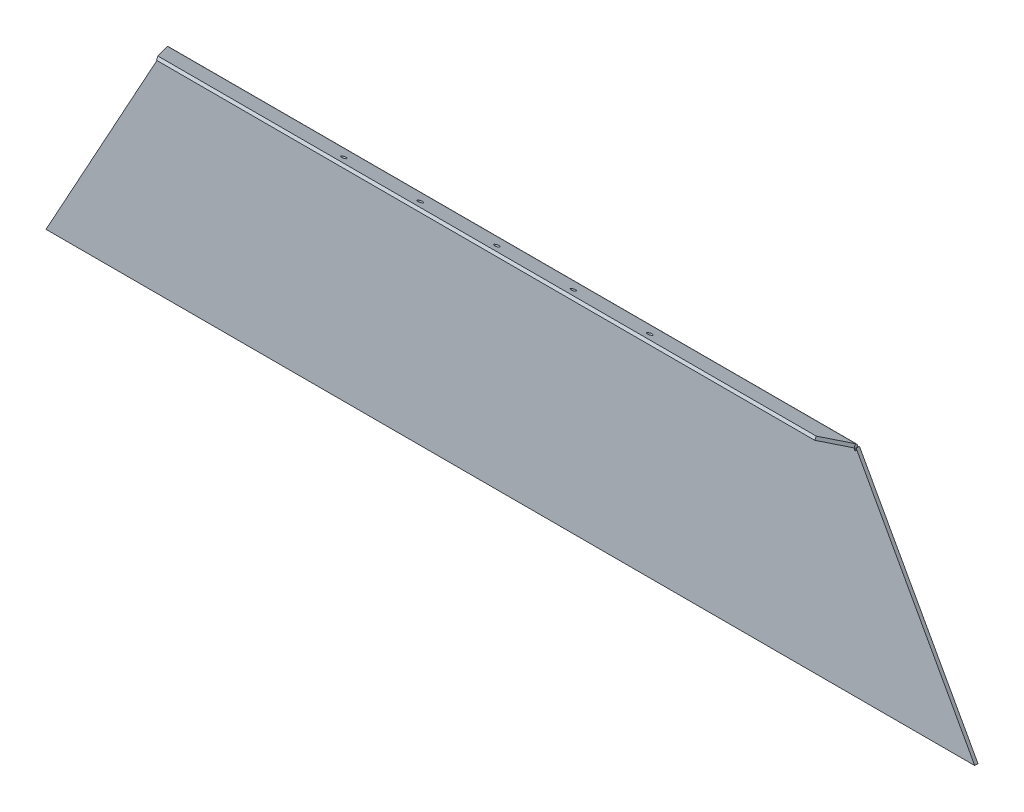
ISO-10303-21;
HEADER;
FILE_DESCRIPTION(('STEP AP214'),'2;1');
FILE_NAME('part.step','',(''),(''),'','','');
FILE_SCHEMA(('AUTOMOTIVE_DESIGN { 1 0 10303 214 1 1 1 1 }'));
ENDSEC;
DATA;
#1=APPLICATION_CONTEXT('core data for automotive mechanical design processes');
#2=APPLICATION_PROTOCOL_DEFINITION('international standard','automotive_design',2000,#1);
#3=PRODUCT_CONTEXT('',#1,'mechanical');
#4=PRODUCT('Part','Part','',(#3));
#5=PRODUCT_RELATED_PRODUCT_CATEGORY('part','',(#4));
#6=PRODUCT_DEFINITION_FORMATION('','',#4);
#7=PRODUCT_DEFINITION_CONTEXT('part definition',#1,'design');
#8=PRODUCT_DEFINITION('design','',#6,#7);
#9=PRODUCT_DEFINITION_SHAPE('','',#8);
#10=(LENGTH_UNIT() NAMED_UNIT(*) SI_UNIT(.MILLI.,.METRE.));
#11=(NAMED_UNIT(*) PLANE_ANGLE_UNIT() SI_UNIT($,.RADIAN.));
#12=(NAMED_UNIT(*) SI_UNIT($,.STERADIAN.) SOLID_ANGLE_UNIT());
#13=UNCERTAINTY_MEASURE_WITH_UNIT(LENGTH_MEASURE(1.E-05),#10,'distance_accuracy_value','');
#14=(GEOMETRIC_REPRESENTATION_CONTEXT(3) GLOBAL_UNCERTAINTY_ASSIGNED_CONTEXT((#13)) GLOBAL_UNIT_ASSIGNED_CONTEXT((#10,
#11,#12)) REPRESENTATION_CONTEXT('',''));
#15=CARTESIAN_POINT('',(0.,0.,0.));
#16=DIRECTION('',(0.,0.,1.));
#17=DIRECTION('',(1.,0.,0.));
#18=AXIS2_PLACEMENT_3D('',#15,#16,#17);
#19=CARTESIAN_POINT('',(-633.,-5.45454545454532,5.99999999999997));
#20=DIRECTION('',(1.,0.,0.));
#21=DIRECTION('',(0.,0.,-1.));
#22=AXIS2_PLACEMENT_3D('',#19,#20,#21);
#23=PLANE('',#22);
#24=DIRECTION('',(0.,-1.,0.));
#25=VECTOR('',#24,1.);
#26=CARTESIAN_POINT('',(-633.,0.,0.));
#27=LINE('',#26,#25);
#28=CARTESIAN_POINT('',(-633.,-5.45454545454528,0.));
#29=VERTEX_POINT('',#28);
#30=CARTESIAN_POINT('',(-633.,-10.0895334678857,0.));
#31=VERTEX_POINT('',#30);
#32=EDGE_CURVE('E13',#29,#31,#27,.T.);
#33=ORIENTED_EDGE('',*,*,#32,.F.);
#34=DIRECTION('',(0.,0.,-1.));
#35=VECTOR('',#34,1.);
#36=CARTESIAN_POINT('',(-633.,-5.45454545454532,5.99999999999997));
#37=LINE('',#36,#35);
#38=CARTESIAN_POINT('',(-633.,-5.45454545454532,5.99999999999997));
#39=VERTEX_POINT('',#38);
#40=EDGE_CURVE('E346',#39,#29,#37,.T.);
#41=ORIENTED_EDGE('',*,*,#40,.F.);
#42=DIRECTION('',(0.,-1.,0.));
#43=VECTOR('',#42,1.);
#44=CARTESIAN_POINT('',(-633.,-5.45454545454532,5.99999999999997));
#45=LINE('',#44,#43);
#46=CARTESIAN_POINT('',(-633.,-10.0895334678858,5.99999999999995));
#47=VERTEX_POINT('',#46);
#48=EDGE_CURVE('E247',#39,#47,#45,.T.);
#49=ORIENTED_EDGE('',*,*,#48,.T.);
#50=DIRECTION('',(0.,0.,-1.));
#51=VECTOR('',#50,1.);
#52=CARTESIAN_POINT('',(-633.,-10.0895334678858,5.99999999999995));
#53=LINE('',#52,#51);
#54=EDGE_CURVE('E337',#47,#31,#53,.T.);
#55=ORIENTED_EDGE('',*,*,#54,.T.);
#56=EDGE_LOOP('',(#33,#41,#49,#55));
#57=FACE_BOUND('',#56,.T.);
#58=ADVANCED_FACE('F51',(#57),#23,.T.);
#59=CARTESIAN_POINT('',(-633.,-10.0895334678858,5.99999999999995));
#60=DIRECTION('',(0.,1.,0.));
#61=DIRECTION('',(0.,0.,1.));
#62=AXIS2_PLACEMENT_3D('',#59,#60,#61);
#63=PLANE('',#62);
#64=DIRECTION('',(1.,0.,0.));
#65=VECTOR('',#64,1.);
#66=CARTESIAN_POINT('',(-630.,-10.0895334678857,0.));
#67=LINE('',#66,#65);
#68=CARTESIAN_POINT('',(-630.,-10.0895334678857,0.));
#69=VERTEX_POINT('',#68);
#70=EDGE_CURVE('E59',#31,#69,#67,.T.);
#71=ORIENTED_EDGE('',*,*,#70,.F.);
#72=ORIENTED_EDGE('',*,*,#54,.F.);
#73=DIRECTION('',(1.,0.,0.));
#74=VECTOR('',#73,1.);
#75=CARTESIAN_POINT('',(-633.,-10.0895334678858,5.99999999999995));
#76=LINE('',#75,#74);
#77=CARTESIAN_POINT('',(-630.,-10.0895334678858,5.99999999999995));
#78=VERTEX_POINT('',#77);
#79=EDGE_CURVE('E343',#47,#78,#76,.T.);
#80=ORIENTED_EDGE('',*,*,#79,.T.);
#81=DIRECTION('',(0.,0.,-1.));
#82=VECTOR('',#81,1.);
#83=CARTESIAN_POINT('',(-630.,-10.0895334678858,5.99999999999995));
#84=LINE('',#83,#82);
#85=EDGE_CURVE('E339',#78,#69,#84,.T.);
#86=ORIENTED_EDGE('',*,*,#85,.T.);
#87=EDGE_LOOP('',(#71,#72,#80,#86));
#88=FACE_BOUND('',#87,.T.);
#89=ADVANCED_FACE('F274',(#88),#63,.T.);
#90=CARTESIAN_POINT('',(-630.,-10.0895334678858,5.99999999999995));
#91=DIRECTION('',(-1.,0.,0.));
#92=DIRECTION('',(0.,0.,1.));
#93=AXIS2_PLACEMENT_3D('',#90,#91,#92);
#94=PLANE('',#93);
#95=DIRECTION('',(0.,1.,0.));
#96=VECTOR('',#95,1.);
#97=CARTESIAN_POINT('',(-630.,0.,0.));
#98=LINE('',#97,#96);
#99=CARTESIAN_POINT('',(-630.,-7.08953346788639,0.));
#100=VERTEX_POINT('',#99);
#101=EDGE_CURVE('E331',#69,#100,#98,.T.);
#102=ORIENTED_EDGE('',*,*,#101,.F.);
#103=ORIENTED_EDGE('',*,*,#85,.F.);
#104=DIRECTION('',(0.,1.,0.));
#105=VECTOR('',#104,1.);
#106=CARTESIAN_POINT('',(-630.,-10.0895334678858,5.99999999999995));
#107=LINE('',#106,#105);
#108=CARTESIAN_POINT('',(-630.,-7.08953346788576,5.99999999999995));
#109=VERTEX_POINT('',#108);
#110=EDGE_CURVE('E344',#78,#109,#107,.T.);
#111=ORIENTED_EDGE('',*,*,#110,.T.);
#112=DIRECTION('',(0.,-1.04799341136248E-13,-1.));
#113=VECTOR('',#112,1.);
#114=CARTESIAN_POINT('',(-630.,-7.08953346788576,5.99999999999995));
#115=LINE('',#114,#113);
#116=EDGE_CURVE('E212',#109,#100,#115,.T.);
#117=ORIENTED_EDGE('',*,*,#116,.T.);
#118=EDGE_LOOP('',(#102,#103,#111,#117));
#119=FACE_BOUND('',#118,.T.);
#120=ADVANCED_FACE('F270',(#119),#94,.T.);
#121=CARTESIAN_POINT('',(630.,-7.08953346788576,5.99999999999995));
#122=DIRECTION('',(1.,0.,0.));
#123=DIRECTION('',(0.,0.,-1.));
#124=AXIS2_PLACEMENT_3D('',#121,#122,#123);
#125=PLANE('',#124);
#126=DIRECTION('',(0.,-1.,0.));
#127=VECTOR('',#126,1.);
#128=CARTESIAN_POINT('',(630.,0.,0.));
#129=LINE('',#128,#127);
#130=CARTESIAN_POINT('',(630.,-7.08953346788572,0.));
#131=VERTEX_POINT('',#130);
#132=CARTESIAN_POINT('',(630.,-10.0895334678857,0.));
#133=VERTEX_POINT('',#132);
#134=EDGE_CURVE('E328',#131,#133,#129,.T.);
#135=ORIENTED_EDGE('',*,*,#134,.F.);
#136=DIRECTION('',(0.,-1.04799341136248E-13,-1.));
#137=VECTOR('',#136,1.);
#138=CARTESIAN_POINT('',(630.,-7.08953346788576,5.99999999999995));
#139=LINE('',#138,#137);
#140=CARTESIAN_POINT('',(630.,-7.08953346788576,5.99999999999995));
#141=VERTEX_POINT('',#140);
#142=EDGE_CURVE('E208',#141,#131,#139,.T.);
#143=ORIENTED_EDGE('',*,*,#142,.F.);
#144=DIRECTION('',(0.,-1.,0.));
#145=VECTOR('',#144,1.);
#146=CARTESIAN_POINT('',(630.,-7.08953346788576,5.99999999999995));
#147=LINE('',#146,#145);
#148=CARTESIAN_POINT('',(630.,-10.0895334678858,5.99999999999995));
#149=VERTEX_POINT('',#148);
#150=EDGE_CURVE('E357',#141,#149,#147,.T.);
#151=ORIENTED_EDGE('',*,*,#150,.T.);
#152=DIRECTION('',(0.,0.,-1.));
#153=VECTOR('',#152,1.);
#154=CARTESIAN_POINT('',(630.,-10.0895334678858,5.99999999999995));
#155=LINE('',#154,#153);
#156=EDGE_CURVE('E365',#149,#133,#155,.T.);
#157=ORIENTED_EDGE('',*,*,#156,.T.);
#158=EDGE_LOOP('',(#135,#143,#151,#157));
#159=FACE_BOUND('',#158,.T.);
#160=ADVANCED_FACE('F266',(#159),#125,.T.);
#161=CARTESIAN_POINT('',(630.,-10.0895334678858,5.99999999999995));
#162=DIRECTION('',(0.,1.,0.));
#163=DIRECTION('',(0.,0.,1.));
#164=AXIS2_PLACEMENT_3D('',#161,#162,#163);
#165=PLANE('',#164);
#166=DIRECTION('',(1.,0.,0.));
#167=VECTOR('',#166,1.);
#168=CARTESIAN_POINT('',(-630.,-10.0895334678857,0.));
#169=LINE('',#168,#167);
#170=CARTESIAN_POINT('',(633.,-10.0895334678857,0.));
#171=VERTEX_POINT('',#170);
#172=EDGE_CURVE('E326',#133,#171,#169,.T.);
#173=ORIENTED_EDGE('',*,*,#172,.F.);
#174=ORIENTED_EDGE('',*,*,#156,.F.);
#175=DIRECTION('',(1.,0.,0.));
#176=VECTOR('',#175,1.);
#177=CARTESIAN_POINT('',(630.,-10.0895334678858,5.99999999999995));
#178=LINE('',#177,#176);
#179=CARTESIAN_POINT('',(633.,-10.0895334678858,5.99999999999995));
#180=VERTEX_POINT('',#179);
#181=EDGE_CURVE('E359',#149,#180,#178,.T.);
#182=ORIENTED_EDGE('',*,*,#181,.T.);
#183=DIRECTION('',(0.,0.,-1.));
#184=VECTOR('',#183,1.);
#185=CARTESIAN_POINT('',(633.,-10.0895334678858,5.99999999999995));
#186=LINE('',#185,#184);
#187=EDGE_CURVE('E211',#180,#171,#186,.T.);
#188=ORIENTED_EDGE('',*,*,#187,.T.);
#189=EDGE_LOOP('',(#173,#174,#182,#188));
#190=FACE_BOUND('',#189,.T.);
#191=ADVANCED_FACE('F263',(#190),#165,.T.);
#192=CARTESIAN_POINT('',(633.,-10.0895334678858,5.99999999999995));
#193=DIRECTION('',(-1.,0.,0.));
#194=DIRECTION('',(0.,0.,1.));
#195=AXIS2_PLACEMENT_3D('',#192,#193,#194);
#196=PLANE('',#195);
#197=DIRECTION('',(0.,1.,0.));
#198=VECTOR('',#197,1.);
#199=CARTESIAN_POINT('',(633.,0.,0.));
#200=LINE('',#199,#198);
#201=CARTESIAN_POINT('',(633.,-5.45454545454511,0.));
#202=VERTEX_POINT('',#201);
#203=EDGE_CURVE('E316',#171,#202,#200,.T.);
#204=ORIENTED_EDGE('',*,*,#203,.F.);
#205=ORIENTED_EDGE('',*,*,#187,.F.);
#206=DIRECTION('',(0.,1.,0.));
#207=VECTOR('',#206,1.);
#208=CARTESIAN_POINT('',(633.,-10.0895334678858,5.99999999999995));
#209=LINE('',#208,#207);
#210=CARTESIAN_POINT('',(633.,-5.4545454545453,5.99999999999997));
#211=VERTEX_POINT('',#210);
#212=EDGE_CURVE('E368',#180,#211,#209,.T.);
#213=ORIENTED_EDGE('',*,*,#212,.T.);
#214=DIRECTION('',(0.,0.,-1.));
#215=VECTOR('',#214,1.);
#216=CARTESIAN_POINT('',(633.,-5.4545454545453,5.99999999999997));
#217=LINE('',#216,#215);
#218=EDGE_CURVE('E66',#211,#202,#217,.T.);
#219=ORIENTED_EDGE('',*,*,#218,.T.);
#220=EDGE_LOOP('',(#204,#205,#213,#219));
#221=FACE_BOUND('',#220,.T.);
#222=ADVANCED_FACE('F254',(#221),#196,.T.);
#223=CARTESIAN_POINT('',(-850.,-400.,6.));
#224=DIRECTION('',(0.876215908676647,-0.481918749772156,0.));
#225=DIRECTION('',(0.481918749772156,0.876215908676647,0.));
#226=AXIS2_PLACEMENT_3D('',#223,#224,#225);
#227=PLANE('',#226);
#228=ORIENTED_EDGE('',*,*,#40,.T.);
#229=DIRECTION('',(-0.481918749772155,-0.876215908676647,0.));
#230=VECTOR('',#229,1.);
#231=CARTESIAN_POINT('',(-850.,-400.,0.));
#232=LINE('',#231,#230);
#233=CARTESIAN_POINT('',(-850.,-400.,0.));
#234=VERTEX_POINT('',#233);
#235=EDGE_CURVE('E310',#29,#234,#232,.T.);
#236=ORIENTED_EDGE('',*,*,#235,.T.);
#237=DIRECTION('',(0.,0.,-1.));
#238=VECTOR('',#237,1.);
#239=CARTESIAN_POINT('',(-850.,-400.,6.));
#240=LINE('',#239,#238);
#241=CARTESIAN_POINT('',(-850.,-400.,6.));
#242=VERTEX_POINT('',#241);
#243=EDGE_CURVE('E306',#242,#234,#240,.T.);
#244=ORIENTED_EDGE('',*,*,#243,.F.);
#245=DIRECTION('',(-0.481918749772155,-0.876215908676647,0.));
#246=VECTOR('',#245,1.);
#247=CARTESIAN_POINT('',(-850.,-400.,6.));
#248=LINE('',#247,#246);
#249=EDGE_CURVE('E317',#39,#242,#248,.T.);
#250=ORIENTED_EDGE('',*,*,#249,.F.);
#251=EDGE_LOOP('',(#228,#236,#244,#250));
#252=FACE_BOUND('',#251,.T.);
#253=ADVANCED_FACE('F53',(#252),#227,.F.);
#254=CARTESIAN_POINT('',(630.,1.5430040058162E-13,6.));
#255=DIRECTION('',(-0.876215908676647,-0.481918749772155,0.));
#256=DIRECTION('',(0.481918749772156,-0.876215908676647,0.));
#257=AXIS2_PLACEMENT_3D('',#254,#255,#256);
#258=PLANE('',#257);
#259=ORIENTED_EDGE('',*,*,#218,.F.);
#260=DIRECTION('',(-0.481918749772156,0.876215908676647,0.));
#261=VECTOR('',#260,1.);
#262=CARTESIAN_POINT('',(630.,1.5430040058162E-13,6.));
#263=LINE('',#262,#261);
#264=CARTESIAN_POINT('',(850.,-400.,6.));
#265=VERTEX_POINT('',#264);
#266=EDGE_CURVE('E313',#265,#211,#263,.T.);
#267=ORIENTED_EDGE('',*,*,#266,.F.);
#268=DIRECTION('',(0.,0.,-1.));
#269=VECTOR('',#268,1.);
#270=CARTESIAN_POINT('',(850.,-400.,6.));
#271=LINE('',#270,#269);
#272=CARTESIAN_POINT('',(850.,-400.,0.));
#273=VERTEX_POINT('',#272);
#274=EDGE_CURVE('E303',#265,#273,#271,.T.);
#275=ORIENTED_EDGE('',*,*,#274,.T.);
#276=DIRECTION('',(-0.481918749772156,0.876215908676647,0.));
#277=VECTOR('',#276,1.);
#278=CARTESIAN_POINT('',(630.,1.5430040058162E-13,0.));
#279=LINE('',#278,#277);
#280=EDGE_CURVE('E309',#273,#202,#279,.T.);
#281=ORIENTED_EDGE('',*,*,#280,.T.);
#282=EDGE_LOOP('',(#259,#267,#275,#281));
#283=FACE_BOUND('',#282,.T.);
#284=ADVANCED_FACE('F290',(#283),#258,.F.);
#285=CARTESIAN_POINT('',(-630.,0.,6.));
#286=DIRECTION('',(0.,0.,-1.));
#287=DIRECTION('',(-1.,0.,0.));
#288=AXIS2_PLACEMENT_3D('',#285,#286,#287);
#289=PLANE('',#288);
#290=ORIENTED_EDGE('',*,*,#48,.F.);
#291=ORIENTED_EDGE('',*,*,#249,.T.);
#292=DIRECTION('',(1.,0.,0.));
#293=VECTOR('',#292,1.);
#294=CARTESIAN_POINT('',(850.,-400.,6.));
#295=LINE('',#294,#293);
#296=EDGE_CURVE('E74',#242,#265,#295,.T.);
#297=ORIENTED_EDGE('',*,*,#296,.T.);
#298=ORIENTED_EDGE('',*,*,#266,.T.);
#299=ORIENTED_EDGE('',*,*,#212,.F.);
#300=ORIENTED_EDGE('',*,*,#181,.F.);
#301=ORIENTED_EDGE('',*,*,#150,.F.);
#302=DIRECTION('',(-1.,0.,0.));
#303=VECTOR('',#302,1.);
#304=CARTESIAN_POINT('',(-630.,-7.08953346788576,5.99999999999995));
#305=LINE('',#304,#303);
#306=EDGE_CURVE('E204',#109,#141,#305,.F.);
#307=ORIENTED_EDGE('',*,*,#306,.F.);
#308=ORIENTED_EDGE('',*,*,#110,.F.);
#309=ORIENTED_EDGE('',*,*,#79,.F.);
#310=EDGE_LOOP('',(#290,#291,#297,#298,#299,#300,#301,#307,#308,#309));
#311=FACE_BOUND('',#310,.T.);
#312=ADVANCED_FACE('F286',(#311),#289,.F.);
#313=CARTESIAN_POINT('',(-630.,0.,0.));
#314=DIRECTION('',(0.,0.,-1.));
#315=DIRECTION('',(-1.,0.,0.));
#316=AXIS2_PLACEMENT_3D('',#313,#314,#315);
#317=PLANE('',#316);
#318=ORIENTED_EDGE('',*,*,#235,.F.);
#319=ORIENTED_EDGE('',*,*,#32,.T.);
#320=ORIENTED_EDGE('',*,*,#70,.T.);
#321=ORIENTED_EDGE('',*,*,#101,.T.);
#322=DIRECTION('',(-1.,0.,0.));
#323=VECTOR('',#322,1.);
#324=CARTESIAN_POINT('',(-630.,-7.08953346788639,0.));
#325=LINE('',#324,#323);
#326=EDGE_CURVE('E159',#100,#131,#325,.F.);
#327=ORIENTED_EDGE('',*,*,#326,.T.);
#328=ORIENTED_EDGE('',*,*,#134,.T.);
#329=ORIENTED_EDGE('',*,*,#172,.T.);
#330=ORIENTED_EDGE('',*,*,#203,.T.);
#331=ORIENTED_EDGE('',*,*,#280,.F.);
#332=DIRECTION('',(1.,0.,0.));
#333=VECTOR('',#332,1.);
#334=CARTESIAN_POINT('',(850.,-400.,0.));
#335=LINE('',#334,#333);
#336=EDGE_CURVE('E301',#234,#273,#335,.T.);
#337=ORIENTED_EDGE('',*,*,#336,.F.);
#338=EDGE_LOOP('',(#318,#319,#320,#321,#327,#328,#329,#330,#331,#337));
#339=FACE_BOUND('',#338,.T.);
#340=ADVANCED_FACE('F282',(#339),#317,.T.);
#341=CARTESIAN_POINT('',(850.,-400.,6.));
#342=DIRECTION('',(0.,1.,0.));
#343=DIRECTION('',(-1.,0.,0.));
#344=AXIS2_PLACEMENT_3D('',#341,#342,#343);
#345=PLANE('',#344);
#346=ORIENTED_EDGE('',*,*,#336,.T.);
#347=ORIENTED_EDGE('',*,*,#274,.F.);
#348=ORIENTED_EDGE('',*,*,#296,.F.);
#349=ORIENTED_EDGE('',*,*,#243,.T.);
#350=EDGE_LOOP('',(#346,#347,#348,#349));
#351=FACE_BOUND('',#350,.T.);
#352=ADVANCED_FACE('F285',(#351),#345,.F.);
#353=CARTESIAN_POINT('',(630.,-7.08953346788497,-0.0600000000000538));
#354=CARTESIAN_POINT('',(629.956950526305,-5.80345257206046,-0.059999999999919));
#355=CARTESIAN_POINT('',(629.913967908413,-4.52155097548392,0.313931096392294));
#356=CARTESIAN_POINT('',(629.827935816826,-2.35389492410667,1.69488030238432));
#357=CARTESIAN_POINT('',(629.784953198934,-1.47324323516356,2.69864759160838));
#358=CARTESIAN_POINT('',(629.741903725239,-0.929721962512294,3.8642327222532));
#359=CARTESIAN_POINT('',(630.,-7.08953346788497,0.));
#360=CARTESIAN_POINT('',(629.956950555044,-5.81480611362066,0.));
#361=CARTESIAN_POINT('',(629.913967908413,-4.54422097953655,0.370630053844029));
#362=CARTESIAN_POINT('',(629.827935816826,-2.39570087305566,1.73938831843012));
#363=CARTESIAN_POINT('',(629.784953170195,-1.52282348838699,2.73429449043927));
#364=CARTESIAN_POINT('',(629.741903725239,-0.984100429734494,3.88958981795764));
#365=CARTESIAN_POINT('',(630.,-7.0895334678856,5.99999999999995));
#366=CARTESIAN_POINT('',(629.956953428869,-6.95016026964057,5.99999999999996));
#367=CARTESIAN_POINT('',(629.913967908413,-6.81122138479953,6.04052579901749));
#368=CARTESIAN_POINT('',(629.827935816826,-6.57629576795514,6.19018992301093));
#369=CARTESIAN_POINT('',(629.78495029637,-6.48084881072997,6.29898437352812));
#370=CARTESIAN_POINT('',(629.741903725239,-6.42194715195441,6.4252993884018));
#371=CARTESIAN_POINT('',(630.,-7.08953346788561,6.06059999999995));
#372=CARTESIAN_POINT('',(629.956953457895,-6.96162734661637,6.06059999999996));
#373=CARTESIAN_POINT('',(629.913967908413,-6.83411808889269,6.09779174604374));
#374=CARTESIAN_POINT('',(629.827935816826,-6.61851977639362,6.23514301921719));
#375=CARTESIAN_POINT('',(629.784950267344,-6.53092486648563,6.33498774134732));
#376=CARTESIAN_POINT('',(629.741903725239,-6.47686940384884,6.45091005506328));
#377=B_SPLINE_SURFACE_WITH_KNOTS('',1,3,((#353,#354,#355,#356,#357,#358),(#359,#360,#361,#362,
#363,#364),(#365,#366,#367,#368,#369,#370),(#371,#372,#373,#374,#375,#376)),.UNSPECIFIED.,.F.,
.F.,.F.,(2,1,1,2),(4,2,4),(-0.01,0.,1.,1.0101),(0.,0.5,1.),.UNSPECIFIED.);
#378=DIRECTION('',(0.,-0.906307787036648,0.422618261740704));
#379=VECTOR('',#378,1.);
#380=CARTESIAN_POINT('',(629.741903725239,-0.984100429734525,3.88958981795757));
#381=LINE('',#380,#379);
#382=CARTESIAN_POINT('',(629.741903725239,-6.42194715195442,6.42529938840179));
#383=VERTEX_POINT('',#382);
#384=CARTESIAN_POINT('',(629.741903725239,-0.98410042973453,3.88958981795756));
#385=VERTEX_POINT('',#384);
#386=EDGE_CURVE('E200',#383,#385,#381,.F.);
#387=CARTESIAN_POINT('',(630.,-7.0895334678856,5.99999999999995));
#388=CARTESIAN_POINT('',(629.986590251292,-7.04612784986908,5.99995727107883));
#389=CARTESIAN_POINT('',(629.97318586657,-7.00273379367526,6.00383394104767));
#390=CARTESIAN_POINT('',(629.946395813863,-6.91733948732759,6.01911071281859));
#391=CARTESIAN_POINT('',(629.933010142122,-6.87533768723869,6.03050213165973));
#392=CARTESIAN_POINT('',(629.90622899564,-6.79397531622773,6.06050064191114));
#393=CARTESIAN_POINT('',(629.89283351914,-6.75461585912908,6.07911075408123));
#394=CARTESIAN_POINT('',(629.866036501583,-6.67976645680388,6.12296255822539));
#395=CARTESIAN_POINT('',(629.852634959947,-6.64427773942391,6.1482063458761));
#396=CARTESIAN_POINT('',(629.825833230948,-6.57827550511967,6.20454740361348));
#397=CARTESIAN_POINT('',(629.812433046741,-6.54776417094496,6.23564722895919));
#398=CARTESIAN_POINT('',(629.785647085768,-6.49273145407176,6.30268720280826));
#399=CARTESIAN_POINT('',(629.772261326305,-6.4681994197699,6.3386185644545));
#400=CARTESIAN_POINT('',(629.753223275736,-6.43805106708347,6.39237581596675));
#401=CARTESIAN_POINT('',(629.74756190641,-6.42968369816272,6.40869619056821));
#402=CARTESIAN_POINT('',(629.741903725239,-6.42194715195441,6.4252993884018));
#403=B_SPLINE_CURVE_WITH_KNOTS('',3,(#387,#388,#389,#390,#391,#392,#393,#394,#395,#396,#397,
#398,#399,#400,#401,#402),.UNSPECIFIED.,.F.,.F.,(4,2,2,2,2,2,2,4),(0.,0.1361062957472,
0.272055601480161,0.408061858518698,0.544111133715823,0.680219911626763,0.816084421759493,
0.873614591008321),.UNSPECIFIED.);
#404=EDGE_CURVE('E162',#141,#383,#403,.T.);
#405=CARTESIAN_POINT('',(630.,-7.08953346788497,0.));
#406=CARTESIAN_POINT('',(629.99359658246,-6.89993731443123,-2.04255063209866E-05));
#407=CARTESIAN_POINT('',(629.98719261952,-6.71034410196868,0.00800318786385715));
#408=CARTESIAN_POINT('',(629.974385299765,-6.33251563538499,0.0399909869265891));
#409=CARTESIAN_POINT('',(629.967981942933,-6.14428031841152,0.063954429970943));
#410=CARTESIAN_POINT('',(629.955182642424,-5.77066839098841,0.127646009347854));
#411=CARTESIAN_POINT('',(629.948786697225,-5.5852893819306,0.167360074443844));
#412=CARTESIAN_POINT('',(629.935995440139,-5.21853889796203,0.262263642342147));
#413=CARTESIAN_POINT('',(629.929600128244,-5.03716736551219,0.317452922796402));
#414=CARTESIAN_POINT('',(629.916806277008,-4.67965046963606,0.442940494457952));
#415=CARTESIAN_POINT('',(629.910407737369,-4.50350713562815,0.513244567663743));
#416=CARTESIAN_POINT('',(629.897608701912,-4.15776902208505,0.66845010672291));
#417=CARTESIAN_POINT('',(629.891208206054,-3.98817438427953,0.753351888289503));
#418=CARTESIAN_POINT('',(629.878407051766,-3.65671893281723,0.93716194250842));
#419=CARTESIAN_POINT('',(629.872006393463,-3.49485931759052,1.03607237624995));
#420=CARTESIAN_POINT('',(629.859204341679,-3.18005938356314,1.24718224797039));
#421=CARTESIAN_POINT('',(629.852802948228,-3.02711877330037,1.35938125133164));
#422=CARTESIAN_POINT('',(629.839997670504,-2.73115524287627,1.59633973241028));
#423=CARTESIAN_POINT('',(629.833593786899,-2.58813804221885,1.72110635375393));
#424=CARTESIAN_POINT('',(629.820787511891,-2.31313958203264,1.98225517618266));
#425=CARTESIAN_POINT('',(629.814385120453,-2.18115803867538,2.11863707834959));
#426=CARTESIAN_POINT('',(629.801586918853,-1.92929571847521,2.40190147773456));
#427=CARTESIAN_POINT('',(629.795191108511,-1.80940297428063,2.54877333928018));
#428=CARTESIAN_POINT('',(629.782400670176,-1.58246401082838,2.85203943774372));
#429=CARTESIAN_POINT('',(629.776006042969,-1.47541197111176,3.00842931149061));
#430=CARTESIAN_POINT('',(629.764989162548,-1.30266984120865,3.28511851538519));
#431=CARTESIAN_POINT('',(629.760366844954,-1.23373881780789,3.4034087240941));
#432=CARTESIAN_POINT('',(629.751130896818,-1.10332532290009,3.6437436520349));
#433=CARTESIAN_POINT('',(629.746517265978,-1.04182934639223,3.76578104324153));
#434=CARTESIAN_POINT('',(629.741903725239,-0.984100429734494,3.88958981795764));
#435=B_SPLINE_CURVE_WITH_KNOTS('',3,(#405,#406,#407,#408,#409,#410,#411,#412,#413,#414,#415,
#416,#417,#418,#419,#420,#421,#422,#423,#424,#425,#426,#427,#428,#429,#430,#431,#432,#433,#434),
.UNSPECIFIED.,.F.,.F.,(4,2,2,2,2,2,2,2,2,2,2,2,2,2,4),(0.,0.568939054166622,1.13785160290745,
1.70625703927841,2.27465430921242,2.84326940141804,3.41189679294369,3.98061200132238,
4.54930861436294,5.11833032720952,5.68733740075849,6.25577553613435,6.82395502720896,
7.23467505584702,7.6446374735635),.UNSPECIFIED.);
#436=EDGE_CURVE('E207',#131,#385,#435,.T.);
#437=ORIENTED_EDGE('',*,*,#386,.F.);
#438=ORIENTED_EDGE('',*,*,#404,.F.);
#439=ORIENTED_EDGE('',*,*,#142,.T.);
#440=ORIENTED_EDGE('',*,*,#436,.T.);
#441=EDGE_LOOP('',(#437,#438,#439,#440));
#442=FACE_BOUND('',#441,.T.);
#443=ADVANCED_FACE('F224',(#442),#377,.F.);
#444=CARTESIAN_POINT('',(-629.741903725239,-0.929721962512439,3.86423272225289));
#445=CARTESIAN_POINT('',(-629.784953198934,-1.47324323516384,2.69864759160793));
#446=CARTESIAN_POINT('',(-629.827935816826,-2.35389492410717,1.6948803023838));
#447=CARTESIAN_POINT('',(-629.913967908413,-4.52155097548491,0.313931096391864));
#448=CARTESIAN_POINT('',(-629.956950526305,-5.8034525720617,-0.0600000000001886));
#449=CARTESIAN_POINT('',(-630.,-7.08953346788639,-0.0600000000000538));
#450=CARTESIAN_POINT('',(-629.741903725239,-0.984100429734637,3.88958981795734));
#451=CARTESIAN_POINT('',(-629.784953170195,-1.52282348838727,2.73429449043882));
#452=CARTESIAN_POINT('',(-629.827935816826,-2.39570087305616,1.73938831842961));
#453=CARTESIAN_POINT('',(-629.913967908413,-4.54422097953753,0.370630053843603));
#454=CARTESIAN_POINT('',(-629.956950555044,-5.81480611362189,-1.87375548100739E-13));
#455=CARTESIAN_POINT('',(-630.,-7.08953346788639,0.));
#456=CARTESIAN_POINT('',(-629.741903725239,-6.42194715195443,6.42529938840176));
#457=CARTESIAN_POINT('',(-629.78495029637,-6.48084881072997,6.29898437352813));
#458=CARTESIAN_POINT('',(-629.827935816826,-6.57629576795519,6.19018992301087));
#459=CARTESIAN_POINT('',(-629.913967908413,-6.81122138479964,6.04052579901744));
#460=CARTESIAN_POINT('',(-629.956953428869,-6.95016026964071,5.99999999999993));
#461=CARTESIAN_POINT('',(-630.,-7.08953346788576,5.99999999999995));
#462=CARTESIAN_POINT('',(-629.741903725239,-6.47686940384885,6.45091005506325));
#463=CARTESIAN_POINT('',(-629.784950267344,-6.53092486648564,6.33498774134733));
#464=CARTESIAN_POINT('',(-629.827935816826,-6.61851977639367,6.23514301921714));
#465=CARTESIAN_POINT('',(-629.913967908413,-6.83411808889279,6.0977917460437));
#466=CARTESIAN_POINT('',(-629.956953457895,-6.9616273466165,6.06059999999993));
#467=CARTESIAN_POINT('',(-630.,-7.08953346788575,6.06059999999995));
#468=B_SPLINE_SURFACE_WITH_KNOTS('',1,3,((#444,#445,#446,#447,#448,#449),(#450,#451,#452,#453,
#454,#455),(#456,#457,#458,#459,#460,#461),(#462,#463,#464,#465,#466,#467)),.UNSPECIFIED.,.F.,
.F.,.F.,(2,1,1,2),(4,2,4),(-0.01,0.,1.,1.0101),(0.,0.5,1.),.UNSPECIFIED.);
#469=CARTESIAN_POINT('',(-629.741903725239,-6.42194715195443,6.42529938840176));
#470=CARTESIAN_POINT('',(-629.755313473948,-6.44025243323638,6.38594248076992));
#471=CARTESIAN_POINT('',(-629.768717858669,-6.46210501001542,6.34825246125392));
#472=CARTESIAN_POINT('',(-629.795507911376,-6.51203966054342,6.27731517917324));
#473=CARTESIAN_POINT('',(-629.808893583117,-6.54011451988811,6.2440628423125));
#474=CARTESIAN_POINT('',(-629.835674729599,-6.60168762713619,6.18300141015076));
#475=CARTESIAN_POINT('',(-629.849070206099,-6.63518814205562,6.15519460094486));
#476=CARTESIAN_POINT('',(-629.875867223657,-6.70656409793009,6.1058905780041));
#477=CARTESIAN_POINT('',(-629.889268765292,-6.74444091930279,6.08439536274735));
#478=CARTESIAN_POINT('',(-629.916070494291,-6.82339700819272,6.0483877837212));
#479=CARTESIAN_POINT('',(-629.929470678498,-6.86447766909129,6.03387847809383));
#480=CARTESIAN_POINT('',(-629.956256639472,-6.94849435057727,6.0123342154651));
#481=CARTESIAN_POINT('',(-629.969642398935,-6.99142690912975,6.00528589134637));
#482=CARTESIAN_POINT('',(-629.988680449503,-7.05288876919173,6.00068100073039));
#483=CARTESIAN_POINT('',(-629.994341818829,-7.07121625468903,5.99999487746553));
#484=CARTESIAN_POINT('',(-630.,-7.08953346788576,5.99999999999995));
#485=B_SPLINE_CURVE_WITH_KNOTS('',3,(#469,#470,#471,#472,#473,#474,#475,#476,#477,#478,#479,
#480,#481,#482,#483,#484),.UNSPECIFIED.,.F.,.F.,(4,2,2,2,2,2,2,4),(0.,0.136106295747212,
0.272055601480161,0.408061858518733,0.544111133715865,0.680219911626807,0.816084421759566,
0.873614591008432),.UNSPECIFIED.);
#486=CARTESIAN_POINT('',(-629.741903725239,-6.42194715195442,6.42529938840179));
#487=VERTEX_POINT('',#486);
#488=EDGE_CURVE('E169',#487,#109,#485,.T.);
#489=DIRECTION('',(0.,-0.906307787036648,0.422618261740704));
#490=VECTOR('',#489,1.);
#491=CARTESIAN_POINT('',(-629.741903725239,-6.42194715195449,6.42529938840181));
#492=LINE('',#491,#490);
#493=CARTESIAN_POINT('',(-629.741903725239,-0.984100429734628,3.88958981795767));
#494=VERTEX_POINT('',#493);
#495=EDGE_CURVE('E166',#487,#494,#492,.F.);
#496=CARTESIAN_POINT('',(-629.741903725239,-0.984100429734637,3.88958981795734));
#497=CARTESIAN_POINT('',(-629.748307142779,-1.06420871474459,3.71774871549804));
#498=CARTESIAN_POINT('',(-629.754711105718,-1.1516061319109,3.54930983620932));
#499=CARTESIAN_POINT('',(-629.767518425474,-1.34027413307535,3.22039958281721));
#500=CARTESIAN_POINT('',(-629.773921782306,-1.44154407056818,3.05992783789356));
#501=CARTESIAN_POINT('',(-629.786721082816,-1.65716346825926,2.748237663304));
#502=CARTESIAN_POINT('',(-629.793117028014,-1.77150118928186,2.59701111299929));
#503=CARTESIAN_POINT('',(-629.8059082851,-2.01250848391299,2.30473027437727));
#504=CARTESIAN_POINT('',(-629.812303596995,-2.13917788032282,2.16367583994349));
#505=CARTESIAN_POINT('',(-629.825097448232,-2.40400141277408,1.89268883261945));
#506=CARTESIAN_POINT('',(-629.83149598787,-2.54215993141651,1.76276054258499));
#507=CARTESIAN_POINT('',(-629.844295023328,-2.82893916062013,1.51500809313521));
#508=CARTESIAN_POINT('',(-629.850695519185,-2.97756009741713,1.39718419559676));
#509=CARTESIAN_POINT('',(-629.863496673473,-3.28422770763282,1.17446502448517));
#510=CARTESIAN_POINT('',(-629.869897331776,-3.44227583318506,1.06957175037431));
#511=CARTESIAN_POINT('',(-629.88269938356,-3.76664655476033,0.873485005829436));
#512=CARTESIAN_POINT('',(-629.889100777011,-3.93296888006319,0.782291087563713));
#513=CARTESIAN_POINT('',(-629.901906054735,-4.2728057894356,0.614200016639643));
#514=CARTESIAN_POINT('',(-629.90830993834,-4.44632443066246,0.537311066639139));
#515=CARTESIAN_POINT('',(-629.921116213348,-4.79922501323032,0.39844408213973));
#516=CARTESIAN_POINT('',(-629.927518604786,-4.97860680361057,0.336465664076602));
#517=CARTESIAN_POINT('',(-629.940316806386,-5.3417731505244,0.227913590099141));
#518=CARTESIAN_POINT('',(-629.946712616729,-5.52555312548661,0.181324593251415));
#519=CARTESIAN_POINT('',(-629.959503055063,-5.89631410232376,0.103813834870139));
#520=CARTESIAN_POINT('',(-629.96589768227,-6.08329360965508,0.072884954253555));
#521=CARTESIAN_POINT('',(-629.976914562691,-6.40706316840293,0.0332613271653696));
#522=CARTESIAN_POINT('',(-629.981536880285,-6.54340201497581,0.0207802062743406));
#523=CARTESIAN_POINT('',(-629.990772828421,-6.81633455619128,0.00415536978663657));
#524=CARTESIAN_POINT('',(-629.995386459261,-6.95292731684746,-3.68245474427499E-06));
#525=CARTESIAN_POINT('',(-630.,-7.08953346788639,0.));
#526=B_SPLINE_CURVE_WITH_KNOTS('',3,(#496,#497,#498,#499,#500,#501,#502,#503,#504,#505,#506,
#507,#508,#509,#510,#511,#512,#513,#514,#515,#516,#517,#518,#519,#520,#521,#522,#523,#524,#525),
.UNSPECIFIED.,.F.,.F.,(4,2,2,2,2,2,2,2,2,2,2,2,2,2,4),(0.,0.568939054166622,1.13785160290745,
1.70625703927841,2.27465430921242,2.84326940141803,3.41189679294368,3.98061200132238,
4.54930861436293,5.11833032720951,5.68733740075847,6.25577553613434,6.82395502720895,
7.23467505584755,7.64463747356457),.UNSPECIFIED.);
#527=EDGE_CURVE('E152',#494,#100,#526,.T.);
#528=ORIENTED_EDGE('',*,*,#488,.F.);
#529=ORIENTED_EDGE('',*,*,#495,.T.);
#530=ORIENTED_EDGE('',*,*,#527,.T.);
#531=ORIENTED_EDGE('',*,*,#116,.F.);
#532=EDGE_LOOP('',(#528,#529,#530,#531));
#533=FACE_BOUND('',#532,.T.);
#534=ADVANCED_FACE('F167',(#533),#468,.F.);
#535=CARTESIAN_POINT('',(-630.,-7.08953346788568,6.73660000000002));
#536=DIRECTION('',(-1.,0.,0.));
#537=DIRECTION('',(0.,0.906307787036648,-0.422618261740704));
#538=AXIS2_PLACEMENT_3D('',#535,#536,#537);
#539=CYLINDRICAL_SURFACE('',#538,6.73660000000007);
#540=ORIENTED_EDGE('',*,*,#326,.F.);
#541=ORIENTED_EDGE('',*,*,#527,.F.);
#542=DIRECTION('',(-1.,0.,0.));
#543=VECTOR('',#542,1.);
#544=CARTESIAN_POINT('',(630.,-0.984100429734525,3.88958981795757));
#545=LINE('',#544,#543);
#546=EDGE_CURVE('E156',#385,#494,#545,.T.);
#547=ORIENTED_EDGE('',*,*,#546,.F.);
#548=ORIENTED_EDGE('',*,*,#436,.F.);
#549=EDGE_LOOP('',(#540,#541,#547,#548));
#550=FACE_BOUND('',#549,.T.);
#551=ADVANCED_FACE('F154',(#550),#539,.T.);
#552=CARTESIAN_POINT('',(-630.,-7.08953346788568,6.73660000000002));
#553=DIRECTION('',(-1.,0.,0.));
#554=DIRECTION('',(0.,0.906307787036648,-0.422618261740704));
#555=AXIS2_PLACEMENT_3D('',#552,#553,#554);
#556=CYLINDRICAL_SURFACE('',#555,0.736600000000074);
#557=ORIENTED_EDGE('',*,*,#306,.T.);
#558=ORIENTED_EDGE('',*,*,#404,.T.);
#559=DIRECTION('',(1.,0.,0.));
#560=VECTOR('',#559,1.);
#561=CARTESIAN_POINT('',(629.741903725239,-6.42194715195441,6.4252993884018));
#562=LINE('',#561,#560);
#563=EDGE_CURVE('E173',#383,#487,#562,.F.);
#564=ORIENTED_EDGE('',*,*,#563,.T.);
#565=ORIENTED_EDGE('',*,*,#488,.T.);
#566=EDGE_LOOP('',(#557,#558,#564,#565));
#567=FACE_BOUND('',#566,.T.);
#568=ADVANCED_FACE('F231',(#567),#556,.F.);
#569=CARTESIAN_POINT('',(-602.5,19.9484922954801,48.7796797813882));
#570=DIRECTION('',(0.876215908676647,-0.203667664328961,-0.43676671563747));
#571=DIRECTION('',(-0.446117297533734,0.,-0.894974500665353));
#572=AXIS2_PLACEMENT_3D('',#569,#570,#571);
#573=PLANE('',#572);
#574=ORIENTED_EDGE('',*,*,#495,.F.);
#575=DIRECTION('',(0.481918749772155,0.370304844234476,0.794121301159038));
#576=VECTOR('',#575,1.);
#577=CARTESIAN_POINT('',(-602.5,14.5106455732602,51.3153893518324));
#578=LINE('',#577,#576);
#579=CARTESIAN_POINT('',(-602.5,14.5106455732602,51.3153893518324));
#580=VERTEX_POINT('',#579);
#581=EDGE_CURVE('E182',#487,#580,#578,.T.);
#582=ORIENTED_EDGE('',*,*,#581,.T.);
#583=DIRECTION('',(0.,-0.906307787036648,0.422618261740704));
#584=VECTOR('',#583,1.);
#585=CARTESIAN_POINT('',(-602.5,19.9484922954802,48.7796797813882));
#586=LINE('',#585,#584);
#587=CARTESIAN_POINT('',(-602.5,19.9484922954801,48.7796797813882));
#588=VERTEX_POINT('',#587);
#589=EDGE_CURVE('E186',#588,#580,#586,.T.);
#590=ORIENTED_EDGE('',*,*,#589,.F.);
#591=DIRECTION('',(-0.481918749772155,-0.370304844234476,-0.794121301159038));
#592=VECTOR('',#591,1.);
#593=CARTESIAN_POINT('',(-337.370441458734,223.67320714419,485.668740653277));
#594=LINE('',#593,#592);
#595=EDGE_CURVE('E178',#494,#588,#594,.F.);
#596=ORIENTED_EDGE('',*,*,#595,.F.);
#597=EDGE_LOOP('',(#574,#582,#590,#596));
#598=FACE_BOUND('',#597,.T.);
#599=ADVANCED_FACE('F184',(#598),#573,.F.);
#600=CARTESIAN_POINT('',(630.,-1.18242079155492,3.46429042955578));
#601=DIRECTION('',(-0.876215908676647,-0.203667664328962,-0.43676671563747));
#602=DIRECTION('',(-0.446117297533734,0.,0.894974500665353));
#603=AXIS2_PLACEMENT_3D('',#600,#601,#602);
#604=PLANE('',#603);
#605=ORIENTED_EDGE('',*,*,#386,.T.);
#606=DIRECTION('',(-0.481918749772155,0.370304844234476,0.794121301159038));
#607=VECTOR('',#606,1.);
#608=CARTESIAN_POINT('',(630.,-1.18242079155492,3.46429042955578));
#609=LINE('',#608,#607);
#610=CARTESIAN_POINT('',(602.5,19.9484922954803,48.7796797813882));
#611=VERTEX_POINT('',#610);
#612=EDGE_CURVE('E181',#611,#385,#609,.F.);
#613=ORIENTED_EDGE('',*,*,#612,.F.);
#614=DIRECTION('',(0.,-0.906307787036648,0.422618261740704));
#615=VECTOR('',#614,1.);
#616=CARTESIAN_POINT('',(602.5,19.9484922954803,48.7796797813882));
#617=LINE('',#616,#615);
#618=CARTESIAN_POINT('',(602.5,14.5106455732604,51.3153893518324));
#619=VERTEX_POINT('',#618);
#620=EDGE_CURVE('E385',#611,#619,#617,.T.);
#621=ORIENTED_EDGE('',*,*,#620,.T.);
#622=DIRECTION('',(0.481918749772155,-0.370304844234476,-0.794121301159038));
#623=VECTOR('',#622,1.);
#624=CARTESIAN_POINT('',(630.,-6.62026751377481,6.));
#625=LINE('',#624,#623);
#626=EDGE_CURVE('E189',#619,#383,#625,.T.);
#627=ORIENTED_EDGE('',*,*,#626,.T.);
#628=EDGE_LOOP('',(#605,#613,#621,#627));
#629=FACE_BOUND('',#628,.T.);
#630=ADVANCED_FACE('F383',(#629),#604,.F.);
#631=CARTESIAN_POINT('',(630.,-1.18242079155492,3.46429042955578));
#632=DIRECTION('',(0.,0.906307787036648,-0.422618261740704));
#633=DIRECTION('',(0.,0.422618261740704,0.906307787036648));
#634=AXIS2_PLACEMENT_3D('',#631,#632,#633);
#635=PLANE('',#634);
#636=CARTESIAN_POINT('',(-280.,11.4961270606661,30.6535240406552));
#637=DIRECTION('',(0.,0.906307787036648,-0.422618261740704));
#638=DIRECTION('',(0.,0.422618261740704,0.906307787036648));
#639=AXIS2_PLACEMENT_3D('',#636,#637,#638);
#640=CIRCLE('',#639,4.5);
#641=CARTESIAN_POINT('',(-280.,13.3979092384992,34.7319090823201));
#642=VERTEX_POINT('',#641);
#643=EDGE_CURVE('E413',#642,#642,#640,.T.);
#644=ORIENTED_EDGE('',*,*,#643,.F.);
#645=EDGE_LOOP('',(#644));
#646=FACE_BOUND('',#645,.T.);
#647=CARTESIAN_POINT('',(-140.,11.4961270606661,30.6535240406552));
#648=DIRECTION('',(0.,0.906307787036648,-0.422618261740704));
#649=DIRECTION('',(0.,0.422618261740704,0.906307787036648));
#650=AXIS2_PLACEMENT_3D('',#647,#648,#649);
#651=CIRCLE('',#650,4.5);
#652=CARTESIAN_POINT('',(-140.,13.3979092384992,34.7319090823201));
#653=VERTEX_POINT('',#652);
#654=EDGE_CURVE('E407',#653,#653,#651,.T.);
#655=ORIENTED_EDGE('',*,*,#654,.F.);
#656=EDGE_LOOP('',(#655));
#657=FACE_BOUND('',#656,.T.);
#658=CARTESIAN_POINT('',(280.,11.4961270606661,30.6535240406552));
#659=DIRECTION('',(0.,0.906307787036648,-0.422618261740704));
#660=DIRECTION('',(0.,0.422618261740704,0.906307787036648));
#661=AXIS2_PLACEMENT_3D('',#658,#659,#660);
#662=CIRCLE('',#661,4.5);
#663=CARTESIAN_POINT('',(280.,13.3979092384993,34.7319090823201));
#664=VERTEX_POINT('',#663);
#665=EDGE_CURVE('E401',#664,#664,#662,.T.);
#666=ORIENTED_EDGE('',*,*,#665,.F.);
#667=EDGE_LOOP('',(#666));
#668=FACE_BOUND('',#667,.T.);
#669=CARTESIAN_POINT('',(140.,11.4961270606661,30.6535240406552));
#670=DIRECTION('',(0.,0.906307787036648,-0.422618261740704));
#671=DIRECTION('',(0.,0.422618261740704,0.906307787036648));
#672=AXIS2_PLACEMENT_3D('',#669,#670,#671);
#673=CIRCLE('',#672,4.5);
#674=CARTESIAN_POINT('',(140.,13.3979092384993,34.7319090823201));
#675=VERTEX_POINT('',#674);
#676=EDGE_CURVE('E395',#675,#675,#673,.T.);
#677=ORIENTED_EDGE('',*,*,#676,.F.);
#678=EDGE_LOOP('',(#677));
#679=FACE_BOUND('',#678,.T.);
#680=CARTESIAN_POINT('',(0.,11.4961270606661,30.6535240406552));
#681=DIRECTION('',(0.,0.906307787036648,-0.422618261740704));
#682=DIRECTION('',(0.,0.422618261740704,0.906307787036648));
#683=AXIS2_PLACEMENT_3D('',#680,#681,#682);
#684=CIRCLE('',#683,4.5);
#685=CARTESIAN_POINT('',(0.,13.3979092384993,34.7319090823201));
#686=VERTEX_POINT('',#685);
#687=EDGE_CURVE('E203',#686,#686,#684,.T.);
#688=ORIENTED_EDGE('',*,*,#687,.F.);
#689=EDGE_LOOP('',(#688));
#690=FACE_BOUND('',#689,.T.);
#691=ORIENTED_EDGE('',*,*,#612,.T.);
#692=ORIENTED_EDGE('',*,*,#546,.T.);
#693=ORIENTED_EDGE('',*,*,#595,.T.);
#694=DIRECTION('',(-1.,0.,0.));
#695=VECTOR('',#694,1.);
#696=CARTESIAN_POINT('',(630.,19.9484922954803,48.7796797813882));
#697=LINE('',#696,#695);
#698=EDGE_CURVE('E188',#588,#611,#697,.F.);
#699=ORIENTED_EDGE('',*,*,#698,.T.);
#700=EDGE_LOOP('',(#691,#692,#693,#699));
#701=FACE_BOUND('',#700,.T.);
#702=ADVANCED_FACE('F177',(#646,#657,#668,#679,#690,#701),#635,.T.);
#703=CARTESIAN_POINT('',(630.,-6.62026751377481,6.));
#704=DIRECTION('',(0.,0.906307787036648,-0.422618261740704));
#705=DIRECTION('',(0.,0.422618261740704,0.906307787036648));
#706=AXIS2_PLACEMENT_3D('',#703,#704,#705);
#707=PLANE('',#706);
#708=CARTESIAN_POINT('',(-280.,6.05828033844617,33.1892336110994));
#709=DIRECTION('',(0.,-0.906307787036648,0.422618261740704));
#710=DIRECTION('',(0.,-0.422618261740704,-0.906307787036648));
#711=AXIS2_PLACEMENT_3D('',#708,#709,#710);
#712=CIRCLE('',#711,4.5);
#713=CARTESIAN_POINT('',(-280.,4.156498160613,29.1108485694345));
#714=VERTEX_POINT('',#713);
#715=EDGE_CURVE('E416',#714,#714,#712,.T.);
#716=ORIENTED_EDGE('',*,*,#715,.F.);
#717=EDGE_LOOP('',(#716));
#718=FACE_BOUND('',#717,.T.);
#719=CARTESIAN_POINT('',(-140.,6.05828033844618,33.1892336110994));
#720=DIRECTION('',(0.,-0.906307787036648,0.422618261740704));
#721=DIRECTION('',(0.,-0.422618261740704,-0.906307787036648));
#722=AXIS2_PLACEMENT_3D('',#719,#720,#721);
#723=CIRCLE('',#722,4.5);
#724=CARTESIAN_POINT('',(-140.,4.15649816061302,29.1108485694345));
#725=VERTEX_POINT('',#724);
#726=EDGE_CURVE('E410',#725,#725,#723,.T.);
#727=ORIENTED_EDGE('',*,*,#726,.F.);
#728=EDGE_LOOP('',(#727));
#729=FACE_BOUND('',#728,.T.);
#730=CARTESIAN_POINT('',(280.,6.0582803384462,33.1892336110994));
#731=DIRECTION('',(0.,-0.906307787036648,0.422618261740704));
#732=DIRECTION('',(0.,-0.422618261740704,-0.906307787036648));
#733=AXIS2_PLACEMENT_3D('',#730,#731,#732);
#734=CIRCLE('',#733,4.5);
#735=CARTESIAN_POINT('',(280.,4.15649816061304,29.1108485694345));
#736=VERTEX_POINT('',#735);
#737=EDGE_CURVE('E404',#736,#736,#734,.T.);
#738=ORIENTED_EDGE('',*,*,#737,.F.);
#739=EDGE_LOOP('',(#738));
#740=FACE_BOUND('',#739,.T.);
#741=CARTESIAN_POINT('',(140.,6.0582803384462,33.1892336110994));
#742=DIRECTION('',(0.,-0.906307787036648,0.422618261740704));
#743=DIRECTION('',(0.,-0.422618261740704,-0.906307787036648));
#744=AXIS2_PLACEMENT_3D('',#741,#742,#743);
#745=CIRCLE('',#744,4.5);
#746=CARTESIAN_POINT('',(140.,4.15649816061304,29.1108485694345));
#747=VERTEX_POINT('',#746);
#748=EDGE_CURVE('E398',#747,#747,#745,.T.);
#749=ORIENTED_EDGE('',*,*,#748,.F.);
#750=EDGE_LOOP('',(#749));
#751=FACE_BOUND('',#750,.T.);
#752=CARTESIAN_POINT('',(0.,6.0582803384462,33.1892336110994));
#753=DIRECTION('',(0.,-0.906307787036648,0.422618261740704));
#754=DIRECTION('',(0.,-0.422618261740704,-0.906307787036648));
#755=AXIS2_PLACEMENT_3D('',#752,#753,#754);
#756=CIRCLE('',#755,4.5);
#757=CARTESIAN_POINT('',(0.,4.15649816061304,29.1108485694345));
#758=VERTEX_POINT('',#757);
#759=EDGE_CURVE('E392',#758,#758,#756,.T.);
#760=ORIENTED_EDGE('',*,*,#759,.F.);
#761=EDGE_LOOP('',(#760));
#762=FACE_BOUND('',#761,.T.);
#763=ORIENTED_EDGE('',*,*,#563,.F.);
#764=ORIENTED_EDGE('',*,*,#626,.F.);
#765=DIRECTION('',(1.,0.,0.));
#766=VECTOR('',#765,1.);
#767=CARTESIAN_POINT('',(602.5,14.5106455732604,51.3153893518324));
#768=LINE('',#767,#766);
#769=EDGE_CURVE('E193',#580,#619,#768,.T.);
#770=ORIENTED_EDGE('',*,*,#769,.F.);
#771=ORIENTED_EDGE('',*,*,#581,.F.);
#772=EDGE_LOOP('',(#763,#764,#770,#771));
#773=FACE_BOUND('',#772,.T.);
#774=ADVANCED_FACE('F379',(#718,#729,#740,#751,#762,#773),#707,.F.);
#775=CARTESIAN_POINT('',(602.5,19.9484922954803,48.7796797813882));
#776=DIRECTION('',(0.,-0.422618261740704,-0.906307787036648));
#777=DIRECTION('',(0.,0.906307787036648,-0.422618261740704));
#778=AXIS2_PLACEMENT_3D('',#775,#776,#777);
#779=PLANE('',#778);
#780=ORIENTED_EDGE('',*,*,#769,.T.);
#781=ORIENTED_EDGE('',*,*,#620,.F.);
#782=ORIENTED_EDGE('',*,*,#698,.F.);
#783=ORIENTED_EDGE('',*,*,#589,.T.);
#784=EDGE_LOOP('',(#780,#781,#782,#783));
#785=FACE_BOUND('',#784,.T.);
#786=ADVANCED_FACE('F424',(#785),#779,.F.);
#787=CARTESIAN_POINT('',(0.,15.1213582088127,28.9630509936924));
#788=DIRECTION('',(0.,-0.906307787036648,0.422618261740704));
#789=DIRECTION('',(0.,-0.422618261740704,-0.906307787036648));
#790=AXIS2_PLACEMENT_3D('',#787,#788,#789);
#791=CYLINDRICAL_SURFACE('',#790,4.5);
#792=ORIENTED_EDGE('',*,*,#687,.T.);
#793=EDGE_LOOP('',(#792));
#794=FACE_BOUND('',#793,.T.);
#795=ORIENTED_EDGE('',*,*,#759,.T.);
#796=EDGE_LOOP('',(#795));
#797=FACE_BOUND('',#796,.T.);
#798=ADVANCED_FACE('F434',(#794,#797),#791,.F.);
#799=CARTESIAN_POINT('',(140.,15.1213582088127,28.9630509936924));
#800=DIRECTION('',(0.,-0.906307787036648,0.422618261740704));
#801=DIRECTION('',(0.,-0.422618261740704,-0.906307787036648));
#802=AXIS2_PLACEMENT_3D('',#799,#800,#801);
#803=CYLINDRICAL_SURFACE('',#802,4.5);
#804=ORIENTED_EDGE('',*,*,#676,.T.);
#805=EDGE_LOOP('',(#804));
#806=FACE_BOUND('',#805,.T.);
#807=ORIENTED_EDGE('',*,*,#748,.T.);
#808=EDGE_LOOP('',(#807));
#809=FACE_BOUND('',#808,.T.);
#810=ADVANCED_FACE('F436',(#806,#809),#803,.F.);
#811=CARTESIAN_POINT('',(280.,15.1213582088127,28.9630509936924));
#812=DIRECTION('',(0.,-0.906307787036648,0.422618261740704));
#813=DIRECTION('',(0.,-0.422618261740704,-0.906307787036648));
#814=AXIS2_PLACEMENT_3D('',#811,#812,#813);
#815=CYLINDRICAL_SURFACE('',#814,4.5);
#816=ORIENTED_EDGE('',*,*,#665,.T.);
#817=EDGE_LOOP('',(#816));
#818=FACE_BOUND('',#817,.T.);
#819=ORIENTED_EDGE('',*,*,#737,.T.);
#820=EDGE_LOOP('',(#819));
#821=FACE_BOUND('',#820,.T.);
#822=ADVANCED_FACE('F444',(#818,#821),#815,.F.);
#823=CARTESIAN_POINT('',(-140.,15.1213582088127,28.9630509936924));
#824=DIRECTION('',(0.,-0.906307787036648,0.422618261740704));
#825=DIRECTION('',(0.,-0.422618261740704,-0.906307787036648));
#826=AXIS2_PLACEMENT_3D('',#823,#824,#825);
#827=CYLINDRICAL_SURFACE('',#826,4.5);
#828=ORIENTED_EDGE('',*,*,#654,.T.);
#829=EDGE_LOOP('',(#828));
#830=FACE_BOUND('',#829,.T.);
#831=ORIENTED_EDGE('',*,*,#726,.T.);
#832=EDGE_LOOP('',(#831));
#833=FACE_BOUND('',#832,.T.);
#834=ADVANCED_FACE('F579',(#830,#833),#827,.F.);
#835=CARTESIAN_POINT('',(-280.,15.1213582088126,28.9630509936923));
#836=DIRECTION('',(0.,-0.906307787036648,0.422618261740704));
#837=DIRECTION('',(0.,-0.422618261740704,-0.906307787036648));
#838=AXIS2_PLACEMENT_3D('',#835,#836,#837);
#839=CYLINDRICAL_SURFACE('',#838,4.5);
#840=ORIENTED_EDGE('',*,*,#643,.T.);
#841=EDGE_LOOP('',(#840));
#842=FACE_BOUND('',#841,.T.);
#843=ORIENTED_EDGE('',*,*,#715,.T.);
#844=EDGE_LOOP('',(#843));
#845=FACE_BOUND('',#844,.T.);
#846=ADVANCED_FACE('F420',(#842,#845),#839,.F.);
#847=CLOSED_SHELL('',(#58,#89,#120,#160,#191,#222,#253,#284,#312,#340,#352,#443,#534,#551,#568,
#599,#630,#702,#774,#786,#798,#810,#822,#834,#846));
#848=MANIFOLD_SOLID_BREP('B2',#847);
#849=ADVANCED_BREP_SHAPE_REPRESENTATION('',(#18,#848),#14);
#850=SHAPE_DEFINITION_REPRESENTATION(#9,#849);
ENDSEC;
END-ISO-10303-21;
